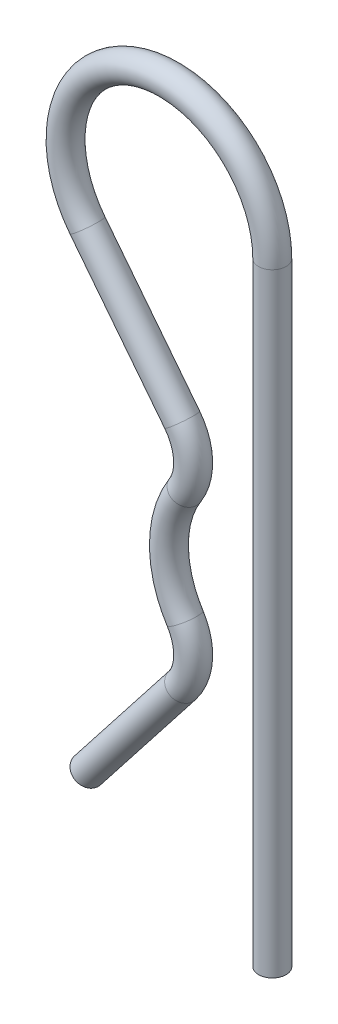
ISO-10303-21;
HEADER;
FILE_DESCRIPTION(('STEP AP214'),'2;1');
FILE_NAME('part.step','',(''),(''),'','','');
FILE_SCHEMA(('AUTOMOTIVE_DESIGN { 1 0 10303 214 1 1 1 1 }'));
ENDSEC;
DATA;
#1=APPLICATION_CONTEXT('core data for automotive mechanical design processes');
#2=APPLICATION_PROTOCOL_DEFINITION('international standard','automotive_design',2000,#1);
#3=PRODUCT_CONTEXT('',#1,'mechanical');
#4=PRODUCT('Part','Part','',(#3));
#5=PRODUCT_RELATED_PRODUCT_CATEGORY('part','',(#4));
#6=PRODUCT_DEFINITION_FORMATION('','',#4);
#7=PRODUCT_DEFINITION_CONTEXT('part definition',#1,'design');
#8=PRODUCT_DEFINITION('design','',#6,#7);
#9=PRODUCT_DEFINITION_SHAPE('','',#8);
#10=(LENGTH_UNIT() NAMED_UNIT(*) SI_UNIT(.MILLI.,.METRE.));
#11=(NAMED_UNIT(*) PLANE_ANGLE_UNIT() SI_UNIT($,.RADIAN.));
#12=(NAMED_UNIT(*) SI_UNIT($,.STERADIAN.) SOLID_ANGLE_UNIT());
#13=UNCERTAINTY_MEASURE_WITH_UNIT(LENGTH_MEASURE(1.E-05),#10,'distance_accuracy_value','');
#14=(GEOMETRIC_REPRESENTATION_CONTEXT(3) GLOBAL_UNCERTAINTY_ASSIGNED_CONTEXT((#13)) GLOBAL_UNIT_ASSIGNED_CONTEXT((#10,
#11,#12)) REPRESENTATION_CONTEXT('',''));
#15=CARTESIAN_POINT('',(0.,0.,0.));
#16=DIRECTION('',(0.,0.,1.));
#17=DIRECTION('',(1.,0.,0.));
#18=AXIS2_PLACEMENT_3D('',#15,#16,#17);
#19=CARTESIAN_POINT('',(-6.53924512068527,-8.35094445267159,0.));
#20=DIRECTION('',(-0.616525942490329,-0.787334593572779,0.));
#21=DIRECTION('',(0.787334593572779,-0.616525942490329,0.));
#22=AXIS2_PLACEMENT_3D('',#19,#20,#21);
#23=CYLINDRICAL_SURFACE('',#22,1.);
#24=CARTESIAN_POINT('',(-6.53924512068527,-8.35094445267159,0.));
#25=DIRECTION('',(-0.616525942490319,-0.787334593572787,0.));
#26=DIRECTION('',(0.,0.,0.999999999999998));
#27=AXIS2_PLACEMENT_3D('',#24,#25,#26);
#28=CIRCLE('',#27,1.);
#29=CARTESIAN_POINT('',(-5.75191052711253,-8.967470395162,0.));
#30=VERTEX_POINT('',#29);
#31=EDGE_CURVE('E35',#30,#30,#28,.T.);
#32=ORIENTED_EDGE('',*,*,#31,.T.);
#33=EDGE_LOOP('',(#32));
#34=FACE_BOUND('',#33,.T.);
#35=CARTESIAN_POINT('',(-13.4050094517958,-17.1188703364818,0.));
#36=DIRECTION('',(-0.616525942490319,-0.787334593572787,0.));
#37=DIRECTION('',(0.,0.,0.999999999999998));
#38=AXIS2_PLACEMENT_3D('',#35,#36,#37);
#39=CIRCLE('',#38,1.);
#40=CARTESIAN_POINT('',(-13.4050094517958,-17.1188703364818,0.999999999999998));
#41=VERTEX_POINT('',#40);
#42=EDGE_CURVE('E10',#41,#41,#39,.T.);
#43=ORIENTED_EDGE('',*,*,#42,.F.);
#44=EDGE_LOOP('',(#43));
#45=FACE_BOUND('',#44,.T.);
#46=ADVANCED_FACE('F29',(#34,#45),#23,.T.);
#47=CARTESIAN_POINT('',(-9.49174984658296,-6.0389721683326,0.));
#48=DIRECTION('',(0.,0.,-0.999999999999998));
#49=DIRECTION('',(-1.,0.,0.));
#50=AXIS2_PLACEMENT_3D('',#47,#48,#49);
#51=TOROIDAL_SURFACE('',#50,3.75,1.);
#52=CARTESIAN_POINT('',(-6.32783323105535,-4.0259814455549,0.));
#53=DIRECTION('',(0.53679752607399,-0.843711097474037,0.));
#54=DIRECTION('',(0.,0.,0.999999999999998));
#55=AXIS2_PLACEMENT_3D('',#52,#53,#54);
#56=CIRCLE('',#55,1.);
#57=CARTESIAN_POINT('',(-5.48412213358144,-3.48918391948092,0.));
#58=VERTEX_POINT('',#57);
#59=EDGE_CURVE('E39',#58,#58,#56,.T.);
#60=CARTESIAN_POINT('',(-9.49174984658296,-6.0389721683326,0.));
#61=DIRECTION('',(0.,0.,-0.999999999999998));
#62=DIRECTION('',(-1.,0.,0.));
#63=AXIS2_PLACEMENT_3D('',#60,#61,#62);
#64=CIRCLE('',#63,4.75);
#65=EDGE_CURVE('',#58,#30,#64,.T.);
#66=ORIENTED_EDGE('',*,*,#59,.T.);
#67=ORIENTED_EDGE('',*,*,#31,.F.);
#68=ORIENTED_EDGE('',*,*,#65,.T.);
#69=ORIENTED_EDGE('',*,*,#65,.F.);
#70=EDGE_LOOP('',(#66,#68,#67,#69));
#71=FACE_BOUND('',#70,.T.);
#72=ADVANCED_FACE('F72',(#71),#51,.T.);
#73=CARTESIAN_POINT('',(0.,0.,0.));
#74=DIRECTION('',(0.,0.,0.999999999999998));
#75=DIRECTION('',(1.,0.,0.));
#76=AXIS2_PLACEMENT_3D('',#73,#74,#75);
#77=TOROIDAL_SURFACE('',#76,7.5,1.);
#78=CARTESIAN_POINT('',(-6.32783323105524,4.02598144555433,0.));
#79=DIRECTION('',(-0.536797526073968,-0.843711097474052,0.));
#80=DIRECTION('',(0.,0.,0.999999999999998));
#81=AXIS2_PLACEMENT_3D('',#78,#79,#80);
#82=CIRCLE('',#81,1.);
#83=CARTESIAN_POINT('',(-5.48412213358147,3.48918391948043,0.));
#84=VERTEX_POINT('',#83);
#85=EDGE_CURVE('E43',#84,#84,#82,.T.);
#86=ORIENTED_EDGE('',*,*,#85,.T.);
#87=EDGE_LOOP('',(#86));
#88=FACE_BOUND('',#87,.T.);
#89=ORIENTED_EDGE('',*,*,#59,.F.);
#90=EDGE_LOOP('',(#89));
#91=FACE_BOUND('',#90,.T.);
#92=ADVANCED_FACE('F76',(#88,#91),#77,.T.);
#93=CARTESIAN_POINT('',(-9.49174984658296,6.03897216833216,0.));
#94=DIRECTION('',(0.,0.,-0.999999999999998));
#95=DIRECTION('',(-1.,0.,0.));
#96=AXIS2_PLACEMENT_3D('',#93,#94,#95);
#97=TOROIDAL_SURFACE('',#96,3.75,1.);
#98=CARTESIAN_POINT('',(-6.53924512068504,8.35094445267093,0.));
#99=DIRECTION('',(0.616525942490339,-0.787334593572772,0.));
#100=DIRECTION('',(0.,0.,0.999999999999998));
#101=AXIS2_PLACEMENT_3D('',#98,#99,#100);
#102=CIRCLE('',#101,1.);
#103=CARTESIAN_POINT('',(-5.75191052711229,8.96747039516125,0.));
#104=VERTEX_POINT('',#103);
#105=EDGE_CURVE('E48',#104,#104,#102,.T.);
#106=CARTESIAN_POINT('',(-9.49174984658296,6.03897216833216,0.));
#107=DIRECTION('',(0.,0.,-0.999999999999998));
#108=DIRECTION('',(-1.,0.,0.));
#109=AXIS2_PLACEMENT_3D('',#106,#107,#108);
#110=CIRCLE('',#109,4.75);
#111=EDGE_CURVE('',#104,#84,#110,.T.);
#112=ORIENTED_EDGE('',*,*,#105,.T.);
#113=ORIENTED_EDGE('',*,*,#85,.F.);
#114=ORIENTED_EDGE('',*,*,#111,.T.);
#115=ORIENTED_EDGE('',*,*,#111,.F.);
#116=EDGE_LOOP('',(#112,#114,#113,#115));
#117=FACE_BOUND('',#116,.T.);
#118=ADVANCED_FACE('F82',(#117),#97,.T.);
#119=CARTESIAN_POINT('',(-13.405009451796,17.118870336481,0.));
#120=DIRECTION('',(0.616525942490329,-0.787334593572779,0.));
#121=DIRECTION('',(0.787334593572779,0.616525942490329,0.));
#122=AXIS2_PLACEMENT_3D('',#119,#120,#121);
#123=CYLINDRICAL_SURFACE('',#122,1.);
#124=CARTESIAN_POINT('',(-13.405009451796,17.118870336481,0.));
#125=DIRECTION('',(0.616525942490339,-0.787334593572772,0.));
#126=DIRECTION('',(0.,0.,0.999999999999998));
#127=AXIS2_PLACEMENT_3D('',#124,#125,#126);
#128=CIRCLE('',#127,1.);
#129=CARTESIAN_POINT('',(-14.1923440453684,16.5023443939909,0.));
#130=VERTEX_POINT('',#129);
#131=EDGE_CURVE('E51',#130,#130,#128,.T.);
#132=ORIENTED_EDGE('',*,*,#131,.T.);
#133=EDGE_LOOP('',(#132));
#134=FACE_BOUND('',#133,.T.);
#135=ORIENTED_EDGE('',*,*,#105,.F.);
#136=EDGE_LOOP('',(#135));
#137=FACE_BOUND('',#136,.T.);
#138=ADVANCED_FACE('F89',(#134,#137),#123,.T.);
#139=CARTESIAN_POINT('',(-7.49999999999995,21.7428149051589,0.));
#140=DIRECTION('',(0.,0.,0.999999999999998));
#141=DIRECTION('',(1.,0.,0.));
#142=AXIS2_PLACEMENT_3D('',#139,#140,#141);
#143=TOROIDAL_SURFACE('',#142,7.5,1.);
#144=CARTESIAN_POINT('',(-1.11022302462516E-13,21.7428149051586,0.));
#145=DIRECTION('',(0.,1.,0.));
#146=DIRECTION('',(0.,0.,0.999999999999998));
#147=AXIS2_PLACEMENT_3D('',#144,#145,#146);
#148=CIRCLE('',#147,1.);
#149=CARTESIAN_POINT('',(1.00000000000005,21.7428149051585,0.));
#150=VERTEX_POINT('',#149);
#151=EDGE_CURVE('E54',#150,#150,#148,.T.);
#152=CARTESIAN_POINT('',(-7.49999999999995,21.7428149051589,0.));
#153=DIRECTION('',(0.,0.,0.999999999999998));
#154=DIRECTION('',(1.,0.,0.));
#155=AXIS2_PLACEMENT_3D('',#152,#153,#154);
#156=CIRCLE('',#155,8.5);
#157=EDGE_CURVE('',#150,#130,#156,.T.);
#158=ORIENTED_EDGE('',*,*,#151,.T.);
#159=ORIENTED_EDGE('',*,*,#131,.F.);
#160=ORIENTED_EDGE('',*,*,#157,.T.);
#161=ORIENTED_EDGE('',*,*,#157,.F.);
#162=EDGE_LOOP('',(#158,#160,#159,#161));
#163=FACE_BOUND('',#162,.T.);
#164=ADVANCED_FACE('F93',(#163),#143,.T.);
#165=CARTESIAN_POINT('',(-1.11022302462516E-13,21.7428149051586,0.));
#166=DIRECTION('',(0.,-1.,0.));
#167=DIRECTION('',(1.,0.,0.));
#168=AXIS2_PLACEMENT_3D('',#165,#166,#167);
#169=CYLINDRICAL_SURFACE('',#168,1.);
#170=ORIENTED_EDGE('',*,*,#151,.F.);
#171=EDGE_LOOP('',(#170));
#172=FACE_BOUND('',#171,.T.);
#173=CARTESIAN_POINT('',(1.11022302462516E-13,-22.7571850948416,0.));
#174=DIRECTION('',(0.,1.,0.));
#175=DIRECTION('',(0.,0.,0.999999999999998));
#176=AXIS2_PLACEMENT_3D('',#173,#174,#175);
#177=CIRCLE('',#176,1.);
#178=CARTESIAN_POINT('',(1.11022302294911E-13,-22.7571850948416,0.999999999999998));
#179=VERTEX_POINT('',#178);
#180=EDGE_CURVE('E57',#179,#179,#177,.T.);
#181=ORIENTED_EDGE('',*,*,#180,.T.);
#182=EDGE_LOOP('',(#181));
#183=FACE_BOUND('',#182,.T.);
#184=ADVANCED_FACE('F61',(#172,#183),#169,.T.);
#185=CARTESIAN_POINT('',(-13.4050094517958,-17.1188703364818,0.));
#186=DIRECTION('',(-0.616525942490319,-0.787334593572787,0.));
#187=DIRECTION('',(0.,0.,0.999999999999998));
#188=AXIS2_PLACEMENT_3D('',#185,#186,#187);
#189=PLANE('',#188);
#190=ORIENTED_EDGE('',*,*,#42,.T.);
#191=EDGE_LOOP('',(#190));
#192=FACE_BOUND('',#191,.T.);
#193=ADVANCED_FACE('F65',(#192),#189,.T.);
#194=CARTESIAN_POINT('',(1.11022302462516E-13,-22.7571850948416,0.));
#195=DIRECTION('',(0.,1.,0.));
#196=DIRECTION('',(0.,0.,0.999999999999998));
#197=AXIS2_PLACEMENT_3D('',#194,#195,#196);
#198=PLANE('',#197);
#199=ORIENTED_EDGE('',*,*,#180,.F.);
#200=EDGE_LOOP('',(#199));
#201=FACE_BOUND('',#200,.T.);
#202=ADVANCED_FACE('F63',(#201),#198,.F.);
#203=CLOSED_SHELL('',(#46,#72,#92,#118,#138,#164,#184,#193,#202));
#204=MANIFOLD_SOLID_BREP('B2',#203);
#205=ADVANCED_BREP_SHAPE_REPRESENTATION('',(#18,#204),#14);
#206=SHAPE_DEFINITION_REPRESENTATION(#9,#205);
ENDSEC;
END-ISO-10303-21;
